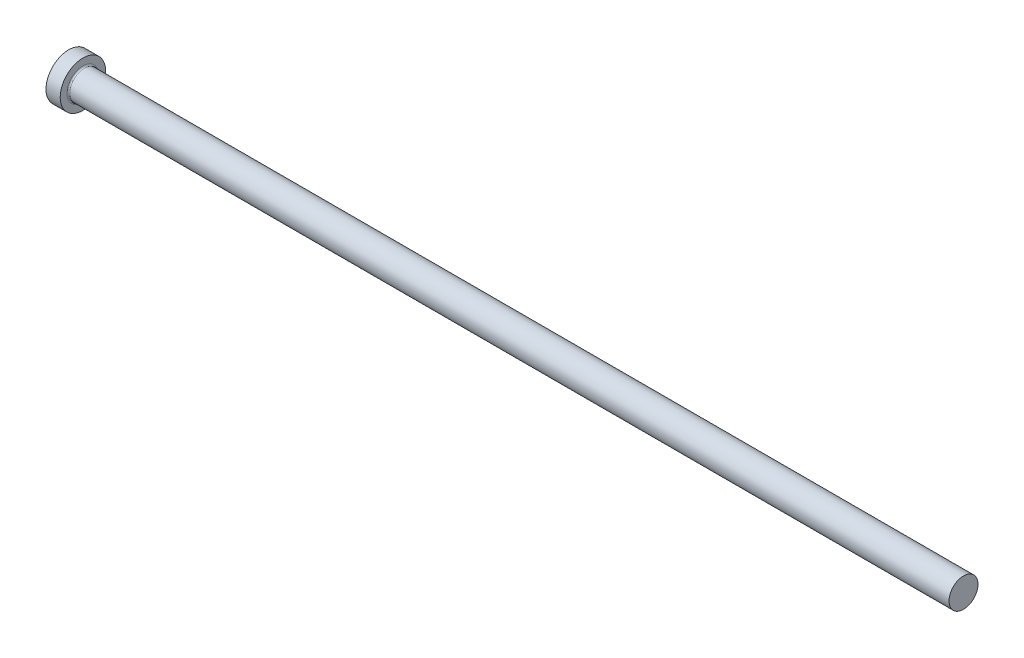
ISO-10303-21;
HEADER;
FILE_DESCRIPTION(('STEP AP214'),'2;1');
FILE_NAME('part.step','',(''),(''),'','','');
FILE_SCHEMA(('AUTOMOTIVE_DESIGN { 1 0 10303 214 1 1 1 1 }'));
ENDSEC;
DATA;
#1=APPLICATION_CONTEXT('core data for automotive mechanical design processes');
#2=APPLICATION_PROTOCOL_DEFINITION('international standard','automotive_design',2000,#1);
#3=PRODUCT_CONTEXT('',#1,'mechanical');
#4=PRODUCT('Part','Part','',(#3));
#5=PRODUCT_RELATED_PRODUCT_CATEGORY('part','',(#4));
#6=PRODUCT_DEFINITION_FORMATION('','',#4);
#7=PRODUCT_DEFINITION_CONTEXT('part definition',#1,'design');
#8=PRODUCT_DEFINITION('design','',#6,#7);
#9=PRODUCT_DEFINITION_SHAPE('','',#8);
#10=(LENGTH_UNIT() NAMED_UNIT(*) SI_UNIT(.MILLI.,.METRE.));
#11=(NAMED_UNIT(*) PLANE_ANGLE_UNIT() SI_UNIT($,.RADIAN.));
#12=(NAMED_UNIT(*) SI_UNIT($,.STERADIAN.) SOLID_ANGLE_UNIT());
#13=UNCERTAINTY_MEASURE_WITH_UNIT(LENGTH_MEASURE(1.E-05),#10,'distance_accuracy_value','');
#14=(GEOMETRIC_REPRESENTATION_CONTEXT(3) GLOBAL_UNCERTAINTY_ASSIGNED_CONTEXT((#13)) GLOBAL_UNIT_ASSIGNED_CONTEXT((#10,
#11,#12)) REPRESENTATION_CONTEXT('',''));
#15=CARTESIAN_POINT('',(0.,0.,0.));
#16=DIRECTION('',(0.,0.,1.));
#17=DIRECTION('',(1.,0.,0.));
#18=AXIS2_PLACEMENT_3D('',#15,#16,#17);
#19=CARTESIAN_POINT('',(0.,0.,0.));
#20=DIRECTION('',(-1.,0.,0.));
#21=DIRECTION('',(0.,-1.,0.));
#22=AXIS2_PLACEMENT_3D('',#19,#20,#21);
#23=PLANE('',#22);
#24=CARTESIAN_POINT('',(0.,0.,0.));
#25=DIRECTION('',(1.,0.,0.));
#26=DIRECTION('',(0.,1.,0.));
#27=AXIS2_PLACEMENT_3D('',#24,#25,#26);
#28=CIRCLE('',#27,8.);
#29=CARTESIAN_POINT('',(0.,8.,0.));
#30=VERTEX_POINT('',#29);
#31=EDGE_CURVE('E25',#30,#30,#28,.T.);
#32=ORIENTED_EDGE('',*,*,#31,.F.);
#33=EDGE_LOOP('',(#32));
#34=FACE_BOUND('',#33,.T.);
#35=ADVANCED_FACE('F14',(#34),#23,.T.);
#36=CARTESIAN_POINT('',(315.,0.,0.));
#37=DIRECTION('',(1.,0.,0.));
#38=DIRECTION('',(0.,1.,0.));
#39=AXIS2_PLACEMENT_3D('',#36,#37,#38);
#40=CYLINDRICAL_SURFACE('',#39,8.);
#41=ORIENTED_EDGE('',*,*,#31,.T.);
#42=EDGE_LOOP('',(#41));
#43=FACE_BOUND('',#42,.T.);
#44=CARTESIAN_POINT('',(5.,0.,0.));
#45=DIRECTION('',(1.,0.,0.));
#46=DIRECTION('',(0.,1.,0.));
#47=AXIS2_PLACEMENT_3D('',#44,#45,#46);
#48=CIRCLE('',#47,8.);
#49=CARTESIAN_POINT('',(5.,8.,0.));
#50=VERTEX_POINT('',#49);
#51=EDGE_CURVE('E29',#50,#50,#48,.T.);
#52=ORIENTED_EDGE('',*,*,#51,.F.);
#53=EDGE_LOOP('',(#52));
#54=FACE_BOUND('',#53,.T.);
#55=ADVANCED_FACE('F51',(#43,#54),#40,.T.);
#56=CARTESIAN_POINT('',(5.,8.,0.));
#57=DIRECTION('',(1.,0.,0.));
#58=DIRECTION('',(0.,1.,0.));
#59=AXIS2_PLACEMENT_3D('',#56,#57,#58);
#60=PLANE('',#59);
#61=CARTESIAN_POINT('',(5.,0.,0.));
#62=DIRECTION('',(1.,0.,0.));
#63=DIRECTION('',(0.,1.,0.));
#64=AXIS2_PLACEMENT_3D('',#61,#62,#63);
#65=CIRCLE('',#64,5.6);
#66=CARTESIAN_POINT('',(5.,5.6,0.));
#67=VERTEX_POINT('',#66);
#68=EDGE_CURVE('E9',#67,#67,#65,.F.);
#69=ORIENTED_EDGE('',*,*,#68,.T.);
#70=EDGE_LOOP('',(#69));
#71=FACE_BOUND('',#70,.T.);
#72=ORIENTED_EDGE('',*,*,#51,.T.);
#73=EDGE_LOOP('',(#72));
#74=FACE_BOUND('',#73,.T.);
#75=ADVANCED_FACE('F42',(#71,#74),#60,.T.);
#76=CARTESIAN_POINT('',(315.,0.,0.));
#77=DIRECTION('',(1.,0.,0.));
#78=DIRECTION('',(0.,1.,0.));
#79=AXIS2_PLACEMENT_3D('',#76,#77,#78);
#80=CYLINDRICAL_SURFACE('',#79,5.1);
#81=CARTESIAN_POINT('',(5.5,0.,0.));
#82=DIRECTION('',(1.,0.,0.));
#83=DIRECTION('',(0.,1.,0.));
#84=AXIS2_PLACEMENT_3D('',#81,#82,#83);
#85=CIRCLE('',#84,5.1);
#86=CARTESIAN_POINT('',(5.5,5.1,0.));
#87=VERTEX_POINT('',#86);
#88=EDGE_CURVE('E21',#87,#87,#85,.T.);
#89=ORIENTED_EDGE('',*,*,#88,.T.);
#90=EDGE_LOOP('',(#89));
#91=FACE_BOUND('',#90,.T.);
#92=CARTESIAN_POINT('',(315.,0.,0.));
#93=DIRECTION('',(1.,0.,0.));
#94=DIRECTION('',(0.,1.,0.));
#95=AXIS2_PLACEMENT_3D('',#92,#93,#94);
#96=CIRCLE('',#95,5.1);
#97=CARTESIAN_POINT('',(315.,5.10000000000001,0.));
#98=VERTEX_POINT('',#97);
#99=EDGE_CURVE('E34',#98,#98,#96,.T.);
#100=ORIENTED_EDGE('',*,*,#99,.F.);
#101=EDGE_LOOP('',(#100));
#102=FACE_BOUND('',#101,.T.);
#103=ADVANCED_FACE('F40',(#91,#102),#80,.T.);
#104=CARTESIAN_POINT('',(315.,5.1,0.));
#105=DIRECTION('',(1.,0.,0.));
#106=DIRECTION('',(0.,1.,0.));
#107=AXIS2_PLACEMENT_3D('',#104,#105,#106);
#108=PLANE('',#107);
#109=ORIENTED_EDGE('',*,*,#99,.T.);
#110=EDGE_LOOP('',(#109));
#111=FACE_BOUND('',#110,.T.);
#112=ADVANCED_FACE('F38',(#111),#108,.T.);
#113=CARTESIAN_POINT('',(5.5,0.,0.));
#114=DIRECTION('',(1.,0.,0.));
#115=DIRECTION('',(0.,1.,0.));
#116=AXIS2_PLACEMENT_3D('',#113,#114,#115);
#117=TOROIDAL_SURFACE('',#116,5.6,0.5);
#118=ORIENTED_EDGE('',*,*,#68,.F.);
#119=EDGE_LOOP('',(#118));
#120=FACE_BOUND('',#119,.T.);
#121=ORIENTED_EDGE('',*,*,#88,.F.);
#122=EDGE_LOOP('',(#121));
#123=FACE_BOUND('',#122,.T.);
#124=ADVANCED_FACE('F16',(#120,#123),#117,.F.);
#125=CLOSED_SHELL('',(#35,#55,#75,#103,#112,#124));
#126=MANIFOLD_SOLID_BREP('B1',#125);
#127=ADVANCED_BREP_SHAPE_REPRESENTATION('',(#18,#126),#14);
#128=SHAPE_DEFINITION_REPRESENTATION(#9,#127);
ENDSEC;
END-ISO-10303-21;
